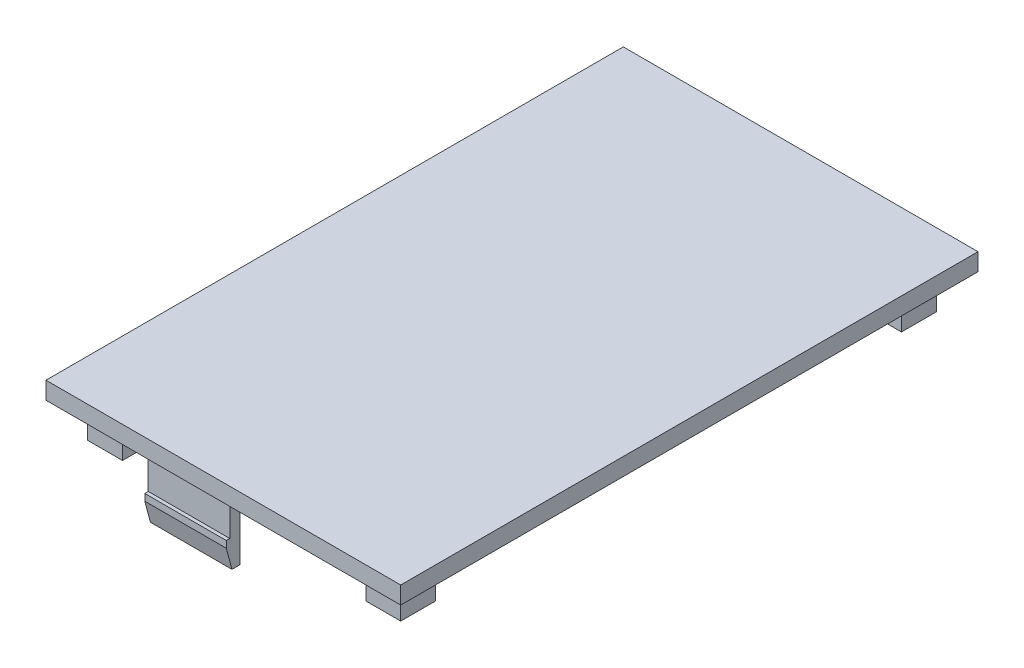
from build123d import *

# Parameters (mm, degrees)
SKETCH1_W           = 51
SKETCH1_H           = 83
BOSS_EXTRUDE1_DEPTH = 2.5
BOSS_EXTRUDE2_DEPTH = 51
SKETCH3_W           = 11.699081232
SKETCH3_H           = 10.602037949
SKETCH3_W_2         = 27.57542474
CUT_EXTRUDE1_DEPTH  = 237.886486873
BOSS_EXTRUDE3_DEPTH = 5


with BuildPart() as part:
    # Sketch1 → Boss-Extrude1 (new body)
    with BuildSketch(Plane(origin=(0, 0, 0), x_dir=(1, 0, 0), z_dir=(0, 1, 0))):
        with Locations((-196.044647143, -41.639503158)):
            Rectangle(SKETCH1_W, SKETCH1_H)
    extrude(amount=BOSS_EXTRUDE1_DEPTH)

    # Sketch2 → Boss-Extrude2 (add)
    with BuildSketch(Plane.ZY.offset(221.544647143)):
        Polygon((3.139503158, 0), (3.139503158, -7), (2.639503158, -7), (2.639503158, -7.966217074), (3.452402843, -11), (4.639503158, -11), (4.639503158, -4), (8.639503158, 0), align=None)
    boss_extrude2 = extrude(amount=-BOSS_EXTRUDE2_DEPTH)

    # Mirror1: Boss-Extrude2 across plane
    add(boss_extrude2.mirror(Plane(origin=(0, 0, 41.639503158), x_dir=(1, 0, 0), z_dir=(0, 0, -1))))

    # Sketch3 → Cut-Extrude1 (cut, through all)
    with BuildSketch(Plane.XZ):
        with Locations((-215.695106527, 77.838484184)):
            Rectangle(SKETCH3_W, SKETCH3_H)
        with Locations((-184.332359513, 77.838484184)):
            Rectangle(SKETCH3_W_2, SKETCH3_H)
        with Locations((-184.332359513, 5.440522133)):
            Rectangle(SKETCH3_W_2, SKETCH3_H)
        with Locations((-215.695106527, 5.440522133)):
            Rectangle(SKETCH3_W, SKETCH3_H)
    extrude(amount=CUT_EXTRUDE1_DEPTH, mode=Mode.SUBTRACT)

    # Sketch4 → Boss-Extrude3 (add)
    with BuildSketch(Plane.XZ):
        Polygon((-213.544647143, 80.139503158), (-213.544647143, 78.139503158), (-216.544647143, 78.139503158), (-216.544647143, 75.139503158), (-218.544647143, 75.139503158), (-218.544647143, 80.139503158), align=None)
        Polygon((-173.544647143, 80.139503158), (-178.544647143, 80.139503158), (-178.544647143, 78.139503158), (-175.544647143, 78.139503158), (-175.544647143, 75.139503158), (-173.544647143, 75.139503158), align=None)
        Polygon((-178.544647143, 3.139503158), (-178.544647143, 5.139503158), (-175.544647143, 5.139503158), (-175.544647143, 8.139503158), (-173.544647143, 8.139503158), (-173.544647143, 3.139503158), align=None)
        Polygon((-218.544647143, 3.139503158), (-213.544647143, 3.139503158), (-213.544647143, 5.139503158), (-216.544647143, 5.139503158), (-216.544647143, 8.139503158), (-218.544647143, 8.139503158), align=None)
    extrude(amount=BOSS_EXTRUDE3_DEPTH)


solid = part.part
